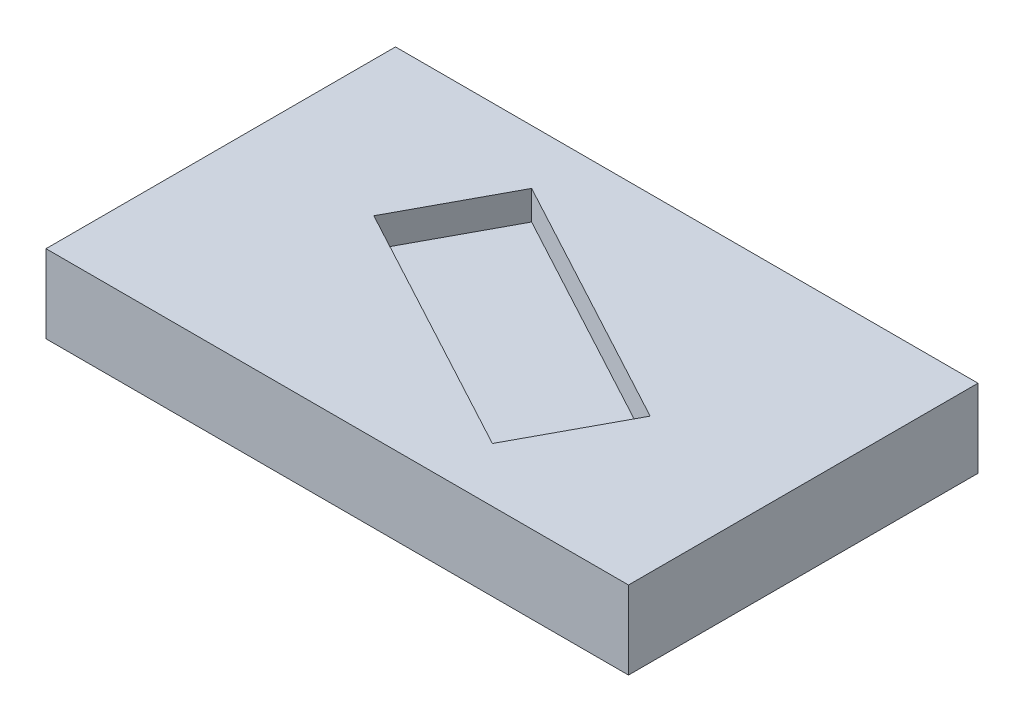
ISO-10303-21;
HEADER;
FILE_DESCRIPTION(('STEP AP214'),'2;1');
FILE_NAME('part.step','',(''),(''),'','','');
FILE_SCHEMA(('AUTOMOTIVE_DESIGN { 1 0 10303 214 1 1 1 1 }'));
ENDSEC;
DATA;
#1=APPLICATION_CONTEXT('core data for automotive mechanical design processes');
#2=APPLICATION_PROTOCOL_DEFINITION('international standard','automotive_design',2000,#1);
#3=PRODUCT_CONTEXT('',#1,'mechanical');
#4=PRODUCT('Part','Part','',(#3));
#5=PRODUCT_RELATED_PRODUCT_CATEGORY('part','',(#4));
#6=PRODUCT_DEFINITION_FORMATION('','',#4);
#7=PRODUCT_DEFINITION_CONTEXT('part definition',#1,'design');
#8=PRODUCT_DEFINITION('design','',#6,#7);
#9=PRODUCT_DEFINITION_SHAPE('','',#8);
#10=(LENGTH_UNIT() NAMED_UNIT(*) SI_UNIT(.MILLI.,.METRE.));
#11=(NAMED_UNIT(*) PLANE_ANGLE_UNIT() SI_UNIT($,.RADIAN.));
#12=(NAMED_UNIT(*) SI_UNIT($,.STERADIAN.) SOLID_ANGLE_UNIT());
#13=UNCERTAINTY_MEASURE_WITH_UNIT(LENGTH_MEASURE(1.E-05),#10,'distance_accuracy_value','');
#14=(GEOMETRIC_REPRESENTATION_CONTEXT(3) GLOBAL_UNCERTAINTY_ASSIGNED_CONTEXT((#13)) GLOBAL_UNIT_ASSIGNED_CONTEXT((#10,
#11,#12)) REPRESENTATION_CONTEXT('',''));
#15=CARTESIAN_POINT('',(0.,0.,0.));
#16=DIRECTION('',(0.,0.,1.));
#17=DIRECTION('',(1.,0.,0.));
#18=AXIS2_PLACEMENT_3D('',#15,#16,#17);
#19=CARTESIAN_POINT('',(-63.5,17.018,-38.1));
#20=DIRECTION('',(1.,0.,0.));
#21=DIRECTION('',(0.,0.,-1.));
#22=AXIS2_PLACEMENT_3D('',#19,#20,#21);
#23=PLANE('',#22);
#24=DIRECTION('',(0.,0.,1.));
#25=VECTOR('',#24,1.);
#26=CARTESIAN_POINT('',(-63.5,0.,-38.1));
#27=LINE('',#26,#25);
#28=CARTESIAN_POINT('',(-63.5,0.,-38.1));
#29=VERTEX_POINT('',#28);
#30=CARTESIAN_POINT('',(-63.5,0.,38.1));
#31=VERTEX_POINT('',#30);
#32=EDGE_CURVE('E137',#29,#31,#27,.T.);
#33=ORIENTED_EDGE('',*,*,#32,.T.);
#34=DIRECTION('',(0.,-1.,0.));
#35=VECTOR('',#34,1.);
#36=CARTESIAN_POINT('',(-63.5,17.018,38.1));
#37=LINE('',#36,#35);
#38=CARTESIAN_POINT('',(-63.5,17.018,38.1));
#39=VERTEX_POINT('',#38);
#40=EDGE_CURVE('E11',#39,#31,#37,.T.);
#41=ORIENTED_EDGE('',*,*,#40,.F.);
#42=DIRECTION('',(0.,0.,1.));
#43=VECTOR('',#42,1.);
#44=CARTESIAN_POINT('',(-63.5,17.018,-38.1));
#45=LINE('',#44,#43);
#46=CARTESIAN_POINT('',(-63.5,17.018,-38.1));
#47=VERTEX_POINT('',#46);
#48=EDGE_CURVE('E148',#47,#39,#45,.T.);
#49=ORIENTED_EDGE('',*,*,#48,.F.);
#50=DIRECTION('',(0.,-1.,0.));
#51=VECTOR('',#50,1.);
#52=CARTESIAN_POINT('',(-63.5,17.018,-38.1));
#53=LINE('',#52,#51);
#54=EDGE_CURVE('E155',#47,#29,#53,.T.);
#55=ORIENTED_EDGE('',*,*,#54,.T.);
#56=EDGE_LOOP('',(#33,#41,#49,#55));
#57=FACE_BOUND('',#56,.T.);
#58=ADVANCED_FACE('F35',(#57),#23,.F.);
#59=CARTESIAN_POINT('',(-63.5,17.018,38.1));
#60=DIRECTION('',(0.,0.,-1.));
#61=DIRECTION('',(-1.,0.,0.));
#62=AXIS2_PLACEMENT_3D('',#59,#60,#61);
#63=PLANE('',#62);
#64=DIRECTION('',(1.,0.,0.));
#65=VECTOR('',#64,1.);
#66=CARTESIAN_POINT('',(-63.5,0.,38.1));
#67=LINE('',#66,#65);
#68=CARTESIAN_POINT('',(63.5,0.,38.1));
#69=VERTEX_POINT('',#68);
#70=EDGE_CURVE('E142',#31,#69,#67,.T.);
#71=ORIENTED_EDGE('',*,*,#70,.T.);
#72=DIRECTION('',(0.,-1.,0.));
#73=VECTOR('',#72,1.);
#74=CARTESIAN_POINT('',(63.5,17.018,38.1));
#75=LINE('',#74,#73);
#76=CARTESIAN_POINT('',(63.5,17.018,38.1));
#77=VERTEX_POINT('',#76);
#78=EDGE_CURVE('E42',#77,#69,#75,.T.);
#79=ORIENTED_EDGE('',*,*,#78,.F.);
#80=DIRECTION('',(1.,0.,0.));
#81=VECTOR('',#80,1.);
#82=CARTESIAN_POINT('',(-63.5,17.018,38.1));
#83=LINE('',#82,#81);
#84=EDGE_CURVE('E150',#39,#77,#83,.T.);
#85=ORIENTED_EDGE('',*,*,#84,.F.);
#86=ORIENTED_EDGE('',*,*,#40,.T.);
#87=EDGE_LOOP('',(#71,#79,#85,#86));
#88=FACE_BOUND('',#87,.T.);
#89=ADVANCED_FACE('F177',(#88),#63,.F.);
#90=CARTESIAN_POINT('',(63.5,17.018,-38.1));
#91=DIRECTION('',(-1.,0.,0.));
#92=DIRECTION('',(0.,0.,1.));
#93=AXIS2_PLACEMENT_3D('',#90,#91,#92);
#94=PLANE('',#93);
#95=DIRECTION('',(0.,0.,-1.));
#96=VECTOR('',#95,1.);
#97=CARTESIAN_POINT('',(63.5,0.,-38.1));
#98=LINE('',#97,#96);
#99=CARTESIAN_POINT('',(63.5,0.,-38.1));
#100=VERTEX_POINT('',#99);
#101=EDGE_CURVE('E144',#69,#100,#98,.T.);
#102=ORIENTED_EDGE('',*,*,#101,.T.);
#103=DIRECTION('',(0.,-1.,0.));
#104=VECTOR('',#103,1.);
#105=CARTESIAN_POINT('',(63.5,17.018,-38.1));
#106=LINE('',#105,#104);
#107=CARTESIAN_POINT('',(63.5,17.018,-38.1));
#108=VERTEX_POINT('',#107);
#109=EDGE_CURVE('E158',#108,#100,#106,.T.);
#110=ORIENTED_EDGE('',*,*,#109,.F.);
#111=DIRECTION('',(0.,0.,-1.));
#112=VECTOR('',#111,1.);
#113=CARTESIAN_POINT('',(63.5,17.018,-38.1));
#114=LINE('',#113,#112);
#115=EDGE_CURVE('E152',#77,#108,#114,.T.);
#116=ORIENTED_EDGE('',*,*,#115,.F.);
#117=ORIENTED_EDGE('',*,*,#78,.T.);
#118=EDGE_LOOP('',(#102,#110,#116,#117));
#119=FACE_BOUND('',#118,.T.);
#120=ADVANCED_FACE('F165',(#119),#94,.F.);
#121=CARTESIAN_POINT('',(-63.5,17.018,-38.1));
#122=DIRECTION('',(0.,0.,1.));
#123=DIRECTION('',(1.,0.,0.));
#124=AXIS2_PLACEMENT_3D('',#121,#122,#123);
#125=PLANE('',#124);
#126=DIRECTION('',(-1.,0.,0.));
#127=VECTOR('',#126,1.);
#128=CARTESIAN_POINT('',(-63.5,0.,-38.1));
#129=LINE('',#128,#127);
#130=EDGE_CURVE('E146',#100,#29,#129,.T.);
#131=ORIENTED_EDGE('',*,*,#130,.T.);
#132=ORIENTED_EDGE('',*,*,#54,.F.);
#133=DIRECTION('',(-1.,0.,0.));
#134=VECTOR('',#133,1.);
#135=CARTESIAN_POINT('',(-63.5,17.018,-38.1));
#136=LINE('',#135,#134);
#137=EDGE_CURVE('E57',#108,#47,#136,.T.);
#138=ORIENTED_EDGE('',*,*,#137,.F.);
#139=ORIENTED_EDGE('',*,*,#109,.T.);
#140=EDGE_LOOP('',(#131,#132,#138,#139));
#141=FACE_BOUND('',#140,.T.);
#142=ADVANCED_FACE('F173',(#141),#125,.F.);
#143=CARTESIAN_POINT('',(-63.5,17.018,38.1));
#144=DIRECTION('',(0.,1.,0.));
#145=DIRECTION('',(0.,0.,1.));
#146=AXIS2_PLACEMENT_3D('',#143,#144,#145);
#147=PLANE('',#146);
#148=DIRECTION('',(-0.473681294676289,0.,0.880696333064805));
#149=VECTOR('',#148,1.);
#150=CARTESIAN_POINT('',(-33.9778610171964,17.018,-3.85453767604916));
#151=LINE('',#150,#149);
#152=CARTESIAN_POINT('',(-21.9463561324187,17.018,-26.2242245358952));
#153=VERTEX_POINT('',#152);
#154=CARTESIAN_POINT('',(-33.9778610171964,17.018,-3.85453767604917));
#155=VERTEX_POINT('',#154);
#156=EDGE_CURVE('E49',#153,#155,#151,.T.);
#157=ORIENTED_EDGE('',*,*,#156,.F.);
#158=DIRECTION('',(-0.880696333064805,0.,-0.47368129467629));
#159=VECTOR('',#158,1.);
#160=CARTESIAN_POINT('',(-21.9463561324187,17.018,-26.2242245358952));
#161=LINE('',#160,#159);
#162=CARTESIAN_POINT('',(33.9778610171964,17.018,3.85453767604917));
#163=VERTEX_POINT('',#162);
#164=EDGE_CURVE('E121',#163,#153,#161,.T.);
#165=ORIENTED_EDGE('',*,*,#164,.F.);
#166=DIRECTION('',(0.47368129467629,0.,-0.880696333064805));
#167=VECTOR('',#166,1.);
#168=CARTESIAN_POINT('',(33.9778610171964,17.018,3.85453767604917));
#169=LINE('',#168,#167);
#170=CARTESIAN_POINT('',(21.9463561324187,17.018,26.2242245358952));
#171=VERTEX_POINT('',#170);
#172=EDGE_CURVE('E104',#171,#163,#169,.T.);
#173=ORIENTED_EDGE('',*,*,#172,.F.);
#174=DIRECTION('',(0.880696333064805,0.,0.473681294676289));
#175=VECTOR('',#174,1.);
#176=CARTESIAN_POINT('',(21.9463561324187,17.018,26.2242245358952));
#177=LINE('',#176,#175);
#178=EDGE_CURVE('E115',#155,#171,#177,.T.);
#179=ORIENTED_EDGE('',*,*,#178,.F.);
#180=EDGE_LOOP('',(#157,#165,#173,#179));
#181=FACE_BOUND('',#180,.T.);
#182=ORIENTED_EDGE('',*,*,#48,.T.);
#183=ORIENTED_EDGE('',*,*,#84,.T.);
#184=ORIENTED_EDGE('',*,*,#115,.T.);
#185=ORIENTED_EDGE('',*,*,#137,.T.);
#186=EDGE_LOOP('',(#182,#183,#184,#185));
#187=FACE_BOUND('',#186,.T.);
#188=ADVANCED_FACE('F119',(#181,#187),#147,.T.);
#189=CARTESIAN_POINT('',(-63.5,0.,38.1));
#190=DIRECTION('',(0.,1.,0.));
#191=DIRECTION('',(0.,0.,1.));
#192=AXIS2_PLACEMENT_3D('',#189,#190,#191);
#193=PLANE('',#192);
#194=ORIENTED_EDGE('',*,*,#32,.F.);
#195=ORIENTED_EDGE('',*,*,#130,.F.);
#196=ORIENTED_EDGE('',*,*,#101,.F.);
#197=ORIENTED_EDGE('',*,*,#70,.F.);
#198=EDGE_LOOP('',(#194,#195,#196,#197));
#199=FACE_BOUND('',#198,.T.);
#200=ADVANCED_FACE('F171',(#199),#193,.F.);
#201=CARTESIAN_POINT('',(-33.9778610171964,10.668,-3.85453767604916));
#202=DIRECTION('',(-0.880696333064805,0.,-0.473681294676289));
#203=DIRECTION('',(-0.473681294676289,0.,0.880696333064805));
#204=AXIS2_PLACEMENT_3D('',#201,#202,#203);
#205=PLANE('',#204);
#206=ORIENTED_EDGE('',*,*,#156,.T.);
#207=DIRECTION('',(0.,1.,0.));
#208=VECTOR('',#207,1.);
#209=CARTESIAN_POINT('',(-33.9778610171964,10.668,-3.85453767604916));
#210=LINE('',#209,#208);
#211=CARTESIAN_POINT('',(-33.9778610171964,10.668,-3.85453767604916));
#212=VERTEX_POINT('',#211);
#213=EDGE_CURVE('E112',#212,#155,#210,.T.);
#214=ORIENTED_EDGE('',*,*,#213,.F.);
#215=DIRECTION('',(-0.473681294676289,0.,0.880696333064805));
#216=VECTOR('',#215,1.);
#217=CARTESIAN_POINT('',(-33.9778610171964,10.668,-3.85453767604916));
#218=LINE('',#217,#216);
#219=CARTESIAN_POINT('',(-21.9463561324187,10.668,-26.2242245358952));
#220=VERTEX_POINT('',#219);
#221=EDGE_CURVE('E123',#220,#212,#218,.T.);
#222=ORIENTED_EDGE('',*,*,#221,.F.);
#223=DIRECTION('',(0.,1.,0.));
#224=VECTOR('',#223,1.);
#225=CARTESIAN_POINT('',(-21.9463561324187,10.668,-26.2242245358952));
#226=LINE('',#225,#224);
#227=EDGE_CURVE('E135',#220,#153,#226,.T.);
#228=ORIENTED_EDGE('',*,*,#227,.T.);
#229=EDGE_LOOP('',(#206,#214,#222,#228));
#230=FACE_BOUND('',#229,.T.);
#231=ADVANCED_FACE('F190',(#230),#205,.F.);
#232=CARTESIAN_POINT('',(-21.9463561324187,10.668,-26.2242245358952));
#233=DIRECTION('',(0.47368129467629,0.,-0.880696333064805));
#234=DIRECTION('',(-0.880696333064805,0.,-0.47368129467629));
#235=AXIS2_PLACEMENT_3D('',#232,#233,#234);
#236=PLANE('',#235);
#237=ORIENTED_EDGE('',*,*,#164,.T.);
#238=ORIENTED_EDGE('',*,*,#227,.F.);
#239=DIRECTION('',(-0.880696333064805,0.,-0.47368129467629));
#240=VECTOR('',#239,1.);
#241=CARTESIAN_POINT('',(-21.9463561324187,10.668,-26.2242245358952));
#242=LINE('',#241,#240);
#243=CARTESIAN_POINT('',(33.9778610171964,10.668,3.85453767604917));
#244=VERTEX_POINT('',#243);
#245=EDGE_CURVE('E132',#244,#220,#242,.T.);
#246=ORIENTED_EDGE('',*,*,#245,.F.);
#247=DIRECTION('',(0.,1.,0.));
#248=VECTOR('',#247,1.);
#249=CARTESIAN_POINT('',(33.9778610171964,10.668,3.85453767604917));
#250=LINE('',#249,#248);
#251=EDGE_CURVE('E111',#244,#163,#250,.T.);
#252=ORIENTED_EDGE('',*,*,#251,.T.);
#253=EDGE_LOOP('',(#237,#238,#246,#252));
#254=FACE_BOUND('',#253,.T.);
#255=ADVANCED_FACE('F193',(#254),#236,.F.);
#256=CARTESIAN_POINT('',(33.9778610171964,10.668,3.85453767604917));
#257=DIRECTION('',(0.880696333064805,0.,0.47368129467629));
#258=DIRECTION('',(0.47368129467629,0.,-0.880696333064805));
#259=AXIS2_PLACEMENT_3D('',#256,#257,#258);
#260=PLANE('',#259);
#261=ORIENTED_EDGE('',*,*,#172,.T.);
#262=ORIENTED_EDGE('',*,*,#251,.F.);
#263=DIRECTION('',(0.47368129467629,0.,-0.880696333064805));
#264=VECTOR('',#263,1.);
#265=CARTESIAN_POINT('',(33.9778610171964,10.668,3.85453767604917));
#266=LINE('',#265,#264);
#267=CARTESIAN_POINT('',(21.9463561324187,10.668,26.2242245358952));
#268=VERTEX_POINT('',#267);
#269=EDGE_CURVE('E107',#268,#244,#266,.T.);
#270=ORIENTED_EDGE('',*,*,#269,.F.);
#271=DIRECTION('',(0.,1.,0.));
#272=VECTOR('',#271,1.);
#273=CARTESIAN_POINT('',(21.9463561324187,10.668,26.2242245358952));
#274=LINE('',#273,#272);
#275=EDGE_CURVE('E100',#268,#171,#274,.T.);
#276=ORIENTED_EDGE('',*,*,#275,.T.);
#277=EDGE_LOOP('',(#261,#262,#270,#276));
#278=FACE_BOUND('',#277,.T.);
#279=ADVANCED_FACE('F102',(#278),#260,.F.);
#280=CARTESIAN_POINT('',(21.9463561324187,10.668,26.2242245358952));
#281=DIRECTION('',(-0.473681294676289,0.,0.880696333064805));
#282=DIRECTION('',(0.880696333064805,0.,0.473681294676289));
#283=AXIS2_PLACEMENT_3D('',#280,#281,#282);
#284=PLANE('',#283);
#285=ORIENTED_EDGE('',*,*,#178,.T.);
#286=ORIENTED_EDGE('',*,*,#275,.F.);
#287=DIRECTION('',(0.880696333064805,0.,0.473681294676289));
#288=VECTOR('',#287,1.);
#289=CARTESIAN_POINT('',(21.9463561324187,10.668,26.2242245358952));
#290=LINE('',#289,#288);
#291=EDGE_CURVE('E129',#212,#268,#290,.T.);
#292=ORIENTED_EDGE('',*,*,#291,.F.);
#293=ORIENTED_EDGE('',*,*,#213,.T.);
#294=EDGE_LOOP('',(#285,#286,#292,#293));
#295=FACE_BOUND('',#294,.T.);
#296=ADVANCED_FACE('F116',(#295),#284,.F.);
#297=CARTESIAN_POINT('',(-33.9778610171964,10.668,-3.85453767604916));
#298=DIRECTION('',(0.,1.,0.));
#299=DIRECTION('',(0.,0.,1.));
#300=AXIS2_PLACEMENT_3D('',#297,#298,#299);
#301=PLANE('',#300);
#302=ORIENTED_EDGE('',*,*,#221,.T.);
#303=ORIENTED_EDGE('',*,*,#291,.T.);
#304=ORIENTED_EDGE('',*,*,#269,.T.);
#305=ORIENTED_EDGE('',*,*,#245,.T.);
#306=EDGE_LOOP('',(#302,#303,#304,#305));
#307=FACE_BOUND('',#306,.T.);
#308=ADVANCED_FACE('F196',(#307),#301,.T.);
#309=CLOSED_SHELL('',(#58,#89,#120,#142,#188,#200,#231,#255,#279,#296,#308));
#310=MANIFOLD_SOLID_BREP('B2',#309);
#311=ADVANCED_BREP_SHAPE_REPRESENTATION('',(#18,#310),#14);
#312=SHAPE_DEFINITION_REPRESENTATION(#9,#311);
ENDSEC;
END-ISO-10303-21;
